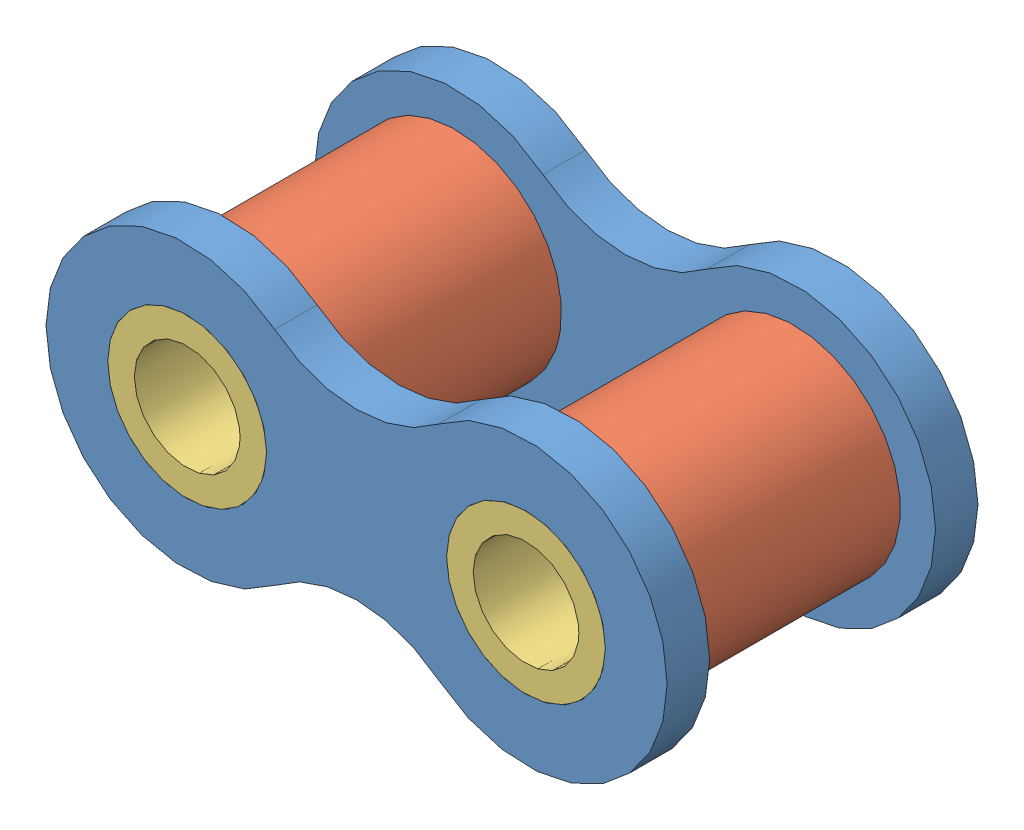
SolidWorks assembly Outside Link.SLDASM, configuration Default (file format 14000). Lengths in mm.
Overall size (34.92 15.88 17.48).
6 component instances, 3 part files, 11 mates.
Components (placement in the parent):
- Link Plate-1: Link Plate.SLDPRT [Inside] at origin size (34.92 15.88 2.39)
- Link Plate-2: Link Plate.SLDPRT [Inside] at (0 0 -15.0876) size (34.92 15.88 2.39)
- Roller-1: Roller.SLDPRT [Default] at (0 0 -6.35) x (0.971201 -0.238261 0) z (0 0 1) size (11.91 11.91 12.7)
- Roller-2: Roller.SLDPRT [Default] at (19.05 0 -6.35) size (11.91 11.91 12.7)
- Bushing-1: Bushing.SLDPRT [Default] at (0 0 -6.35) size (8.93 8.93 17.48)
- Bushing-2: Bushing.SLDPRT [Default] at (19.05 0 -6.35) size (8.93 8.93 17.48)
Mates (geometry in assembly coordinates):
- Concentric1: concentric aligned: cylinder of Link Plate-1 through (0 0 2.3876) axis (0 0 -1) radius 4.464; cylinder of Roller-1 through (0 0 0) axis (0 0 -1) radius 4.464
- Coincident1: coincident anti-aligned: plane of Link Plate-1 through (4.7625 -6.0378 0) normal (0 0 -1); plane of Roller-1 through (0 0 0) normal (0 0 1)
- Concentric2: concentric aligned: cylinder of Link Plate-1 through (19.05 0 2.3876) axis (0 0 -1) radius 4.464; cylinder of Roller-2 through (19.05 0 0) axis (0 0 -1) radius 4.464
- Coincident2: coincident anti-aligned: plane of Link Plate-1 through (4.7625 -6.0378 0) normal (0 0 -1); plane of Roller-2 through (19.05 0 0) normal (0 0 1)
- Concentric3: concentric aligned: cylinder of Link Plate-2 through (0 0 -12.7) axis (0 0 -1) radius 4.464; cylinder of Roller-1 through (0 0 0) axis (0 0 -1) radius 4.464
- Coincident3: coincident anti-aligned: plane of Link Plate-2 through (4.7625 -6.0378 -12.7) normal (0 0 1); plane of Roller-1 through (0 0 -12.7) normal (0 0 -1)
- Concentric4: concentric aligned: cylinder of Link Plate-2 through (19.05 0 -12.7) axis (0 0 -1) radius 4.464; cylinder of Roller-2 through (19.05 0 0) axis (0 0 -1) radius 4.464
- Concentric5: concentric aligned: cylinder of Link Plate-1 through (0 0 2.3876) axis (0 0 -1) radius 4.464; cylinder of Bushing-1 through (0 0 2.3876) axis (0 0 -1) radius 4.464
- Coincident4: coincident aligned: plane of Link Plate-1 through (4.7625 -6.0378 2.3876) normal (0 0 1); plane of Bushing-1 through (0 0 2.3876) normal (0 0 1)
- Concentric6: concentric aligned: cylinder of Link Plate-1 through (19.05 0 2.3876) axis (0 0 -1) radius 4.464; cylinder of Bushing-2 through (19.05 0 2.3876) axis (0 0 -1) radius 4.464
- Coincident5: coincident aligned: plane of Link Plate-1 through (4.7625 -6.0378 2.3876) normal (0 0 1); plane of Bushing-2 through (19.05 0 2.3876) normal (0 0 1)
